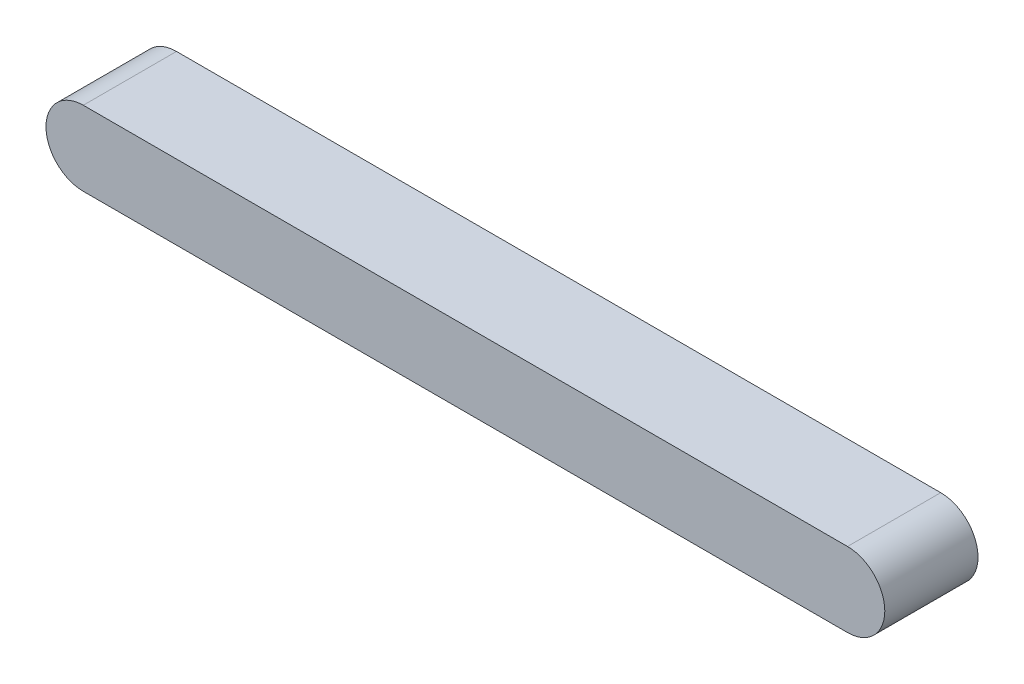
ISO-10303-21;
HEADER;
FILE_DESCRIPTION(('STEP AP214'),'2;1');
FILE_NAME('part.step','',(''),(''),'','','');
FILE_SCHEMA(('AUTOMOTIVE_DESIGN { 1 0 10303 214 1 1 1 1 }'));
ENDSEC;
DATA;
#1=APPLICATION_CONTEXT('core data for automotive mechanical design processes');
#2=APPLICATION_PROTOCOL_DEFINITION('international standard','automotive_design',2000,#1);
#3=PRODUCT_CONTEXT('',#1,'mechanical');
#4=PRODUCT('Part','Part','',(#3));
#5=PRODUCT_RELATED_PRODUCT_CATEGORY('part','',(#4));
#6=PRODUCT_DEFINITION_FORMATION('','',#4);
#7=PRODUCT_DEFINITION_CONTEXT('part definition',#1,'design');
#8=PRODUCT_DEFINITION('design','',#6,#7);
#9=PRODUCT_DEFINITION_SHAPE('','',#8);
#10=(LENGTH_UNIT() NAMED_UNIT(*) SI_UNIT(.MILLI.,.METRE.));
#11=(NAMED_UNIT(*) PLANE_ANGLE_UNIT() SI_UNIT($,.RADIAN.));
#12=(NAMED_UNIT(*) SI_UNIT($,.STERADIAN.) SOLID_ANGLE_UNIT());
#13=UNCERTAINTY_MEASURE_WITH_UNIT(LENGTH_MEASURE(1.E-05),#10,'distance_accuracy_value','');
#14=(GEOMETRIC_REPRESENTATION_CONTEXT(3) GLOBAL_UNCERTAINTY_ASSIGNED_CONTEXT((#13)) GLOBAL_UNIT_ASSIGNED_CONTEXT((#10,
#11,#12)) REPRESENTATION_CONTEXT('',''));
#15=CARTESIAN_POINT('',(0.,0.,0.));
#16=DIRECTION('',(0.,0.,1.));
#17=DIRECTION('',(1.,0.,0.));
#18=AXIS2_PLACEMENT_3D('',#15,#16,#17);
#19=CARTESIAN_POINT('',(-20.5,0.,-5.));
#20=DIRECTION('',(0.,0.,1.));
#21=DIRECTION('',(1.,0.,0.));
#22=AXIS2_PLACEMENT_3D('',#19,#20,#21);
#23=CYLINDRICAL_SURFACE('',#22,2.);
#24=CARTESIAN_POINT('',(-20.5,0.,0.));
#25=DIRECTION('',(0.,0.,1.));
#26=DIRECTION('',(-1.,0.,0.));
#27=AXIS2_PLACEMENT_3D('',#24,#25,#26);
#28=CIRCLE('',#27,2.);
#29=CARTESIAN_POINT('',(-20.5,2.,0.));
#30=VERTEX_POINT('',#29);
#31=CARTESIAN_POINT('',(-20.5,-2.,0.));
#32=VERTEX_POINT('',#31);
#33=EDGE_CURVE('E101',#30,#32,#28,.T.);
#34=ORIENTED_EDGE('',*,*,#33,.F.);
#35=DIRECTION('',(0.,0.,1.));
#36=VECTOR('',#35,1.);
#37=CARTESIAN_POINT('',(-20.5,2.,-5.));
#38=LINE('',#37,#36);
#39=CARTESIAN_POINT('',(-20.5,2.,-5.));
#40=VERTEX_POINT('',#39);
#41=EDGE_CURVE('E11',#40,#30,#38,.T.);
#42=ORIENTED_EDGE('',*,*,#41,.F.);
#43=CARTESIAN_POINT('',(-20.5,0.,-5.));
#44=DIRECTION('',(0.,0.,1.));
#45=DIRECTION('',(-1.,0.,0.));
#46=AXIS2_PLACEMENT_3D('',#43,#44,#45);
#47=CIRCLE('',#46,2.);
#48=CARTESIAN_POINT('',(-20.5,-2.,-5.));
#49=VERTEX_POINT('',#48);
#50=EDGE_CURVE('E95',#40,#49,#47,.T.);
#51=ORIENTED_EDGE('',*,*,#50,.T.);
#52=DIRECTION('',(0.,0.,1.));
#53=VECTOR('',#52,1.);
#54=CARTESIAN_POINT('',(-20.5,-2.,-5.));
#55=LINE('',#54,#53);
#56=EDGE_CURVE('E40',#49,#32,#55,.T.);
#57=ORIENTED_EDGE('',*,*,#56,.T.);
#58=EDGE_LOOP('',(#34,#42,#51,#57));
#59=FACE_BOUND('',#58,.T.);
#60=ADVANCED_FACE('F37',(#59),#23,.T.);
#61=CARTESIAN_POINT('',(-20.5,2.,-5.));
#62=DIRECTION('',(0.,1.,0.));
#63=DIRECTION('',(0.,0.,1.));
#64=AXIS2_PLACEMENT_3D('',#61,#62,#63);
#65=PLANE('',#64);
#66=DIRECTION('',(-1.,0.,0.));
#67=VECTOR('',#66,1.);
#68=CARTESIAN_POINT('',(-20.5,2.,0.));
#69=LINE('',#68,#67);
#70=CARTESIAN_POINT('',(20.5,2.,0.));
#71=VERTEX_POINT('',#70);
#72=EDGE_CURVE('E97',#71,#30,#69,.T.);
#73=ORIENTED_EDGE('',*,*,#72,.F.);
#74=DIRECTION('',(0.,0.,1.));
#75=VECTOR('',#74,1.);
#76=CARTESIAN_POINT('',(20.5,2.,-5.));
#77=LINE('',#76,#75);
#78=CARTESIAN_POINT('',(20.5,2.,-5.));
#79=VERTEX_POINT('',#78);
#80=EDGE_CURVE('E46',#79,#71,#77,.T.);
#81=ORIENTED_EDGE('',*,*,#80,.F.);
#82=DIRECTION('',(-1.,0.,0.));
#83=VECTOR('',#82,1.);
#84=CARTESIAN_POINT('',(-20.5,2.,-5.));
#85=LINE('',#84,#83);
#86=EDGE_CURVE('E92',#79,#40,#85,.T.);
#87=ORIENTED_EDGE('',*,*,#86,.T.);
#88=ORIENTED_EDGE('',*,*,#41,.T.);
#89=EDGE_LOOP('',(#73,#81,#87,#88));
#90=FACE_BOUND('',#89,.T.);
#91=ADVANCED_FACE('F111',(#90),#65,.T.);
#92=CARTESIAN_POINT('',(20.5,0.,-5.));
#93=DIRECTION('',(0.,0.,1.));
#94=DIRECTION('',(1.,0.,0.));
#95=AXIS2_PLACEMENT_3D('',#92,#93,#94);
#96=CYLINDRICAL_SURFACE('',#95,2.);
#97=CARTESIAN_POINT('',(20.5,0.,0.));
#98=DIRECTION('',(0.,0.,1.));
#99=DIRECTION('',(1.,0.,0.));
#100=AXIS2_PLACEMENT_3D('',#97,#98,#99);
#101=CIRCLE('',#100,2.);
#102=CARTESIAN_POINT('',(20.5,-2.,0.));
#103=VERTEX_POINT('',#102);
#104=EDGE_CURVE('E87',#103,#71,#101,.T.);
#105=ORIENTED_EDGE('',*,*,#104,.F.);
#106=DIRECTION('',(0.,0.,1.));
#107=VECTOR('',#106,1.);
#108=CARTESIAN_POINT('',(20.5,-2.,-5.));
#109=LINE('',#108,#107);
#110=CARTESIAN_POINT('',(20.5,-2.,-5.));
#111=VERTEX_POINT('',#110);
#112=EDGE_CURVE('E82',#111,#103,#109,.T.);
#113=ORIENTED_EDGE('',*,*,#112,.F.);
#114=CARTESIAN_POINT('',(20.5,0.,-5.));
#115=DIRECTION('',(0.,0.,1.));
#116=DIRECTION('',(1.,0.,0.));
#117=AXIS2_PLACEMENT_3D('',#114,#115,#116);
#118=CIRCLE('',#117,2.);
#119=EDGE_CURVE('E85',#111,#79,#118,.T.);
#120=ORIENTED_EDGE('',*,*,#119,.T.);
#121=ORIENTED_EDGE('',*,*,#80,.T.);
#122=EDGE_LOOP('',(#105,#113,#120,#121));
#123=FACE_BOUND('',#122,.T.);
#124=ADVANCED_FACE('F84',(#123),#96,.T.);
#125=CARTESIAN_POINT('',(-20.5,-2.,-5.));
#126=DIRECTION('',(0.,-1.,0.));
#127=DIRECTION('',(0.,0.,-1.));
#128=AXIS2_PLACEMENT_3D('',#125,#126,#127);
#129=PLANE('',#128);
#130=DIRECTION('',(1.,0.,0.));
#131=VECTOR('',#130,1.);
#132=CARTESIAN_POINT('',(-20.5,-2.,0.));
#133=LINE('',#132,#131);
#134=EDGE_CURVE('E104',#32,#103,#133,.T.);
#135=ORIENTED_EDGE('',*,*,#134,.F.);
#136=ORIENTED_EDGE('',*,*,#56,.F.);
#137=DIRECTION('',(1.,0.,0.));
#138=VECTOR('',#137,1.);
#139=CARTESIAN_POINT('',(-20.5,-2.,-5.));
#140=LINE('',#139,#138);
#141=EDGE_CURVE('E91',#49,#111,#140,.T.);
#142=ORIENTED_EDGE('',*,*,#141,.T.);
#143=ORIENTED_EDGE('',*,*,#112,.T.);
#144=EDGE_LOOP('',(#135,#136,#142,#143));
#145=FACE_BOUND('',#144,.T.);
#146=ADVANCED_FACE('F94',(#145),#129,.T.);
#147=CARTESIAN_POINT('',(-20.5,0.,-5.));
#148=DIRECTION('',(0.,0.,-1.));
#149=DIRECTION('',(-1.,0.,0.));
#150=AXIS2_PLACEMENT_3D('',#147,#148,#149);
#151=PLANE('',#150);
#152=ORIENTED_EDGE('',*,*,#50,.F.);
#153=ORIENTED_EDGE('',*,*,#86,.F.);
#154=ORIENTED_EDGE('',*,*,#119,.F.);
#155=ORIENTED_EDGE('',*,*,#141,.F.);
#156=EDGE_LOOP('',(#152,#153,#154,#155));
#157=FACE_BOUND('',#156,.T.);
#158=ADVANCED_FACE('F90',(#157),#151,.T.);
#159=CARTESIAN_POINT('',(-20.5,0.,0.));
#160=DIRECTION('',(0.,0.,-1.));
#161=DIRECTION('',(-1.,0.,0.));
#162=AXIS2_PLACEMENT_3D('',#159,#160,#161);
#163=PLANE('',#162);
#164=ORIENTED_EDGE('',*,*,#33,.T.);
#165=ORIENTED_EDGE('',*,*,#134,.T.);
#166=ORIENTED_EDGE('',*,*,#104,.T.);
#167=ORIENTED_EDGE('',*,*,#72,.T.);
#168=EDGE_LOOP('',(#164,#165,#166,#167));
#169=FACE_BOUND('',#168,.T.);
#170=ADVANCED_FACE('F110',(#169),#163,.F.);
#171=CLOSED_SHELL('',(#60,#91,#124,#146,#158,#170));
#172=MANIFOLD_SOLID_BREP('B2',#171);
#173=ADVANCED_BREP_SHAPE_REPRESENTATION('',(#18,#172),#14);
#174=SHAPE_DEFINITION_REPRESENTATION(#9,#173);
ENDSEC;
END-ISO-10303-21;
